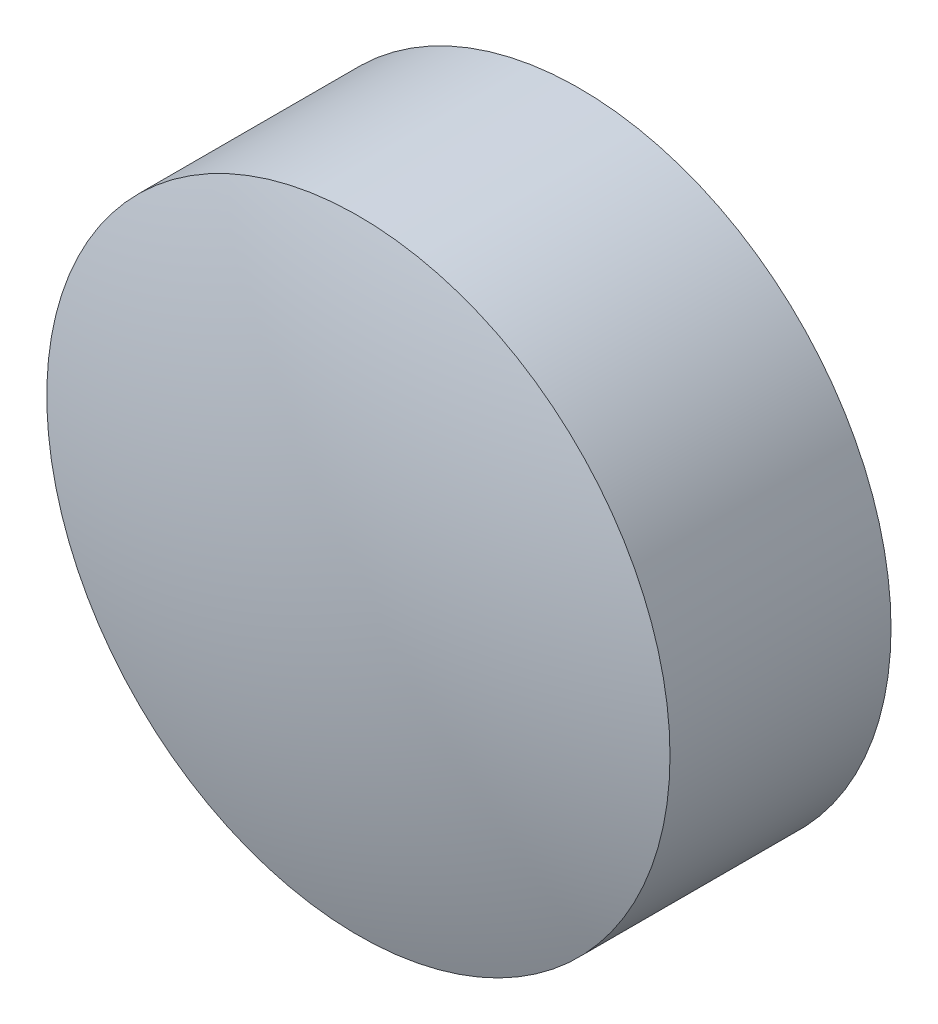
ISO-10303-21;
HEADER;
FILE_DESCRIPTION(('STEP AP214'),'2;1');
FILE_NAME('part.step','',(''),(''),'','','');
FILE_SCHEMA(('AUTOMOTIVE_DESIGN { 1 0 10303 214 1 1 1 1 }'));
ENDSEC;
DATA;
#1=APPLICATION_CONTEXT('core data for automotive mechanical design processes');
#2=APPLICATION_PROTOCOL_DEFINITION('international standard','automotive_design',2000,#1);
#3=PRODUCT_CONTEXT('',#1,'mechanical');
#4=PRODUCT('Part','Part','',(#3));
#5=PRODUCT_RELATED_PRODUCT_CATEGORY('part','',(#4));
#6=PRODUCT_DEFINITION_FORMATION('','',#4);
#7=PRODUCT_DEFINITION_CONTEXT('part definition',#1,'design');
#8=PRODUCT_DEFINITION('design','',#6,#7);
#9=PRODUCT_DEFINITION_SHAPE('','',#8);
#10=(LENGTH_UNIT() NAMED_UNIT(*) SI_UNIT(.MILLI.,.METRE.));
#11=(NAMED_UNIT(*) PLANE_ANGLE_UNIT() SI_UNIT($,.RADIAN.));
#12=(NAMED_UNIT(*) SI_UNIT($,.STERADIAN.) SOLID_ANGLE_UNIT());
#13=UNCERTAINTY_MEASURE_WITH_UNIT(LENGTH_MEASURE(1.E-05),#10,'distance_accuracy_value','');
#14=(GEOMETRIC_REPRESENTATION_CONTEXT(3) GLOBAL_UNCERTAINTY_ASSIGNED_CONTEXT((#13)) GLOBAL_UNIT_ASSIGNED_CONTEXT((#10,
#11,#12)) REPRESENTATION_CONTEXT('',''));
#15=CARTESIAN_POINT('',(0.,0.,0.));
#16=DIRECTION('',(0.,0.,1.));
#17=DIRECTION('',(1.,0.,0.));
#18=AXIS2_PLACEMENT_3D('',#15,#16,#17);
#19=CARTESIAN_POINT('',(0.,0.,12.057));
#20=DIRECTION('',(0.,0.,-1.));
#21=DIRECTION('',(-1.,0.,0.));
#22=AXIS2_PLACEMENT_3D('',#19,#20,#21);
#23=CYLINDRICAL_SURFACE('',#22,17.);
#24=CARTESIAN_POINT('',(0.,0.,12.057));
#25=DIRECTION('',(0.,0.,1.));
#26=DIRECTION('',(1.,0.,0.));
#27=AXIS2_PLACEMENT_3D('',#24,#25,#26);
#28=CIRCLE('',#27,17.);
#29=CARTESIAN_POINT('',(17.,0.,12.057));
#30=VERTEX_POINT('',#29);
#31=EDGE_CURVE('E10',#30,#30,#28,.T.);
#32=ORIENTED_EDGE('',*,*,#31,.F.);
#33=EDGE_LOOP('',(#32));
#34=FACE_BOUND('',#33,.T.);
#35=CARTESIAN_POINT('',(0.,0.,0.));
#36=DIRECTION('',(0.,0.,1.));
#37=DIRECTION('',(1.,0.,0.));
#38=AXIS2_PLACEMENT_3D('',#35,#36,#37);
#39=CIRCLE('',#38,17.);
#40=CARTESIAN_POINT('',(17.,0.,0.));
#41=VERTEX_POINT('',#40);
#42=EDGE_CURVE('E39',#41,#41,#39,.T.);
#43=ORIENTED_EDGE('',*,*,#42,.T.);
#44=EDGE_LOOP('',(#43));
#45=FACE_BOUND('',#44,.T.);
#46=ADVANCED_FACE('F32',(#34,#45),#23,.T.);
#47=CARTESIAN_POINT('',(0.,0.,-41.5709657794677));
#48=DIRECTION('',(0.,0.,1.));
#49=DIRECTION('',(1.,0.,0.));
#50=AXIS2_PLACEMENT_3D('',#47,#48,#49);
#51=SPHERICAL_SURFACE('',#50,56.2579657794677);
#52=ORIENTED_EDGE('',*,*,#31,.T.);
#53=EDGE_LOOP('',(#52));
#54=FACE_BOUND('',#53,.T.);
#55=ADVANCED_FACE('F34',(#54),#51,.T.);
#56=CARTESIAN_POINT('',(0.,0.,63.3889285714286));
#57=DIRECTION('',(0.,0.,1.));
#58=DIRECTION('',(1.,0.,0.));
#59=AXIS2_PLACEMENT_3D('',#56,#57,#58);
#60=SPHERICAL_SURFACE('',#59,65.6289285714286);
#61=ORIENTED_EDGE('',*,*,#42,.F.);
#62=EDGE_LOOP('',(#61));
#63=FACE_BOUND('',#62,.T.);
#64=ADVANCED_FACE('F46',(#63),#60,.T.);
#65=CLOSED_SHELL('',(#46,#55,#64));
#66=MANIFOLD_SOLID_BREP('B2',#65);
#67=ADVANCED_BREP_SHAPE_REPRESENTATION('',(#18,#66),#14);
#68=SHAPE_DEFINITION_REPRESENTATION(#9,#67);
ENDSEC;
END-ISO-10303-21;
